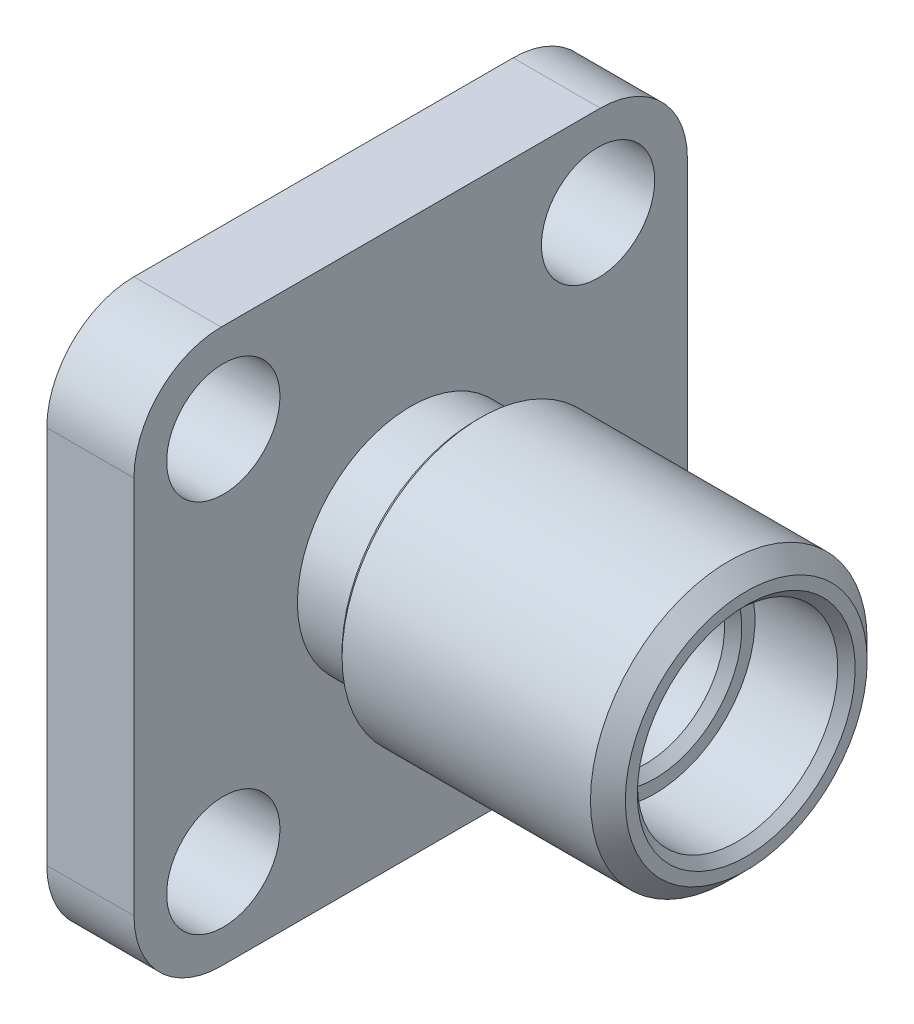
from build123d import *

# Parameters (mm, degrees)
SKETCH_3_R              = 8.5
CUT_EXTRUDE_1_DEPTH     = 2
CHAMFER_2_SIZE          = 0.4
CHAMFER_1_SIZE          = 0.2
CHAMFER_3_SIZE          = 0.1
HOLE_WIZARD_2_6_2_6_1_D = 2.6


with BuildPart() as part:
    # Sketch 2 → Revolve 1 (revolve)
    with BuildSketch(Plane.XY, mode=Mode.PRIVATE) as revolve_1_sk:
        Polygon((0, 2), (0, 8.5), (2, 8.5), (2, 2.6), (3.5, 2.6), (3.5, 3.175), (9.7, 3.175), (9.7, 2.3), (7.6, 2.3), (7.6, 1.8), (6.5, 1.8), (6.5, 2), align=None)
    revolve(revolve_1_sk.sketch.rotate(Axis((0, 0, 0), (1, 0, 0)), 90), axis=Axis((0, 0, 0), (1, 0, 0)))

    # Sketch 3 → Cut-Extrude 1 (cut)
    with BuildSketch(Plane(origin=(2, 0, 0), x_dir=(0, 0, -1), z_dir=(1, 0, 0))):
        Circle(SKETCH_3_R)
        with BuildLine():
            Line((-4.35, -6.35), (4.35, -6.35))
            ThreePointArc((4.35, -6.35), (5.764213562, -5.764213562), (6.35, -4.35))
            Line((6.35, -4.35), (6.35, 4.35))
            ThreePointArc((6.35, 4.35), (5.764213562, 5.764213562), (4.35, 6.35))
            Line((4.35, 6.35), (-4.35, 6.35))
            ThreePointArc((-4.35, 6.35), (-5.764213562, 5.764213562), (-6.35, 4.35))
            Line((-6.35, 4.35), (-6.35, -4.35))
            ThreePointArc((-6.35, -4.35), (-5.764213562, -5.764213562), (-4.35, -6.35))
        make_face(mode=Mode.SUBTRACT)
    extrude(amount=-CUT_EXTRUDE_1_DEPTH, mode=Mode.SUBTRACT)

    # Chamfer 2
    chamfer_2_edges = [part.edges().sort_by_distance(p)[0] for p in [
        (9.7, 0, -3.175),
    ]]
    chamfer(chamfer_2_edges, length=CHAMFER_2_SIZE)

    # Chamfer 1
    chamfer_1_edges = [part.edges().sort_by_distance(p)[0] for p in [
        (7.6, 0, -1.8),
        (9.7, 0, -2.3),
    ]]
    chamfer(chamfer_1_edges, length=CHAMFER_1_SIZE)

    # Chamfer 3
    chamfer_3_edges = [part.edges().sort_by_distance(p)[0] for p in [
        (3.5, 0, -3.175),
        (0, 0, -2),
        (6.5, 0, -1.8),
    ]]
    chamfer(chamfer_3_edges, length=CHAMFER_3_SIZE)

    # Hole Wizard 2.6 _2.6_ _1 (through all)
    with Locations(Plane(origin=(2, 0, 0), x_dir=(0, 0, -1), z_dir=(1, 0, 0))):
        with Locations((-4.3, 4.3), (4.3, 4.3), (4.3, -4.3), (-4.3, -4.3)):
            Hole(HOLE_WIZARD_2_6_2_6_1_D / 2)


solid = part.part
